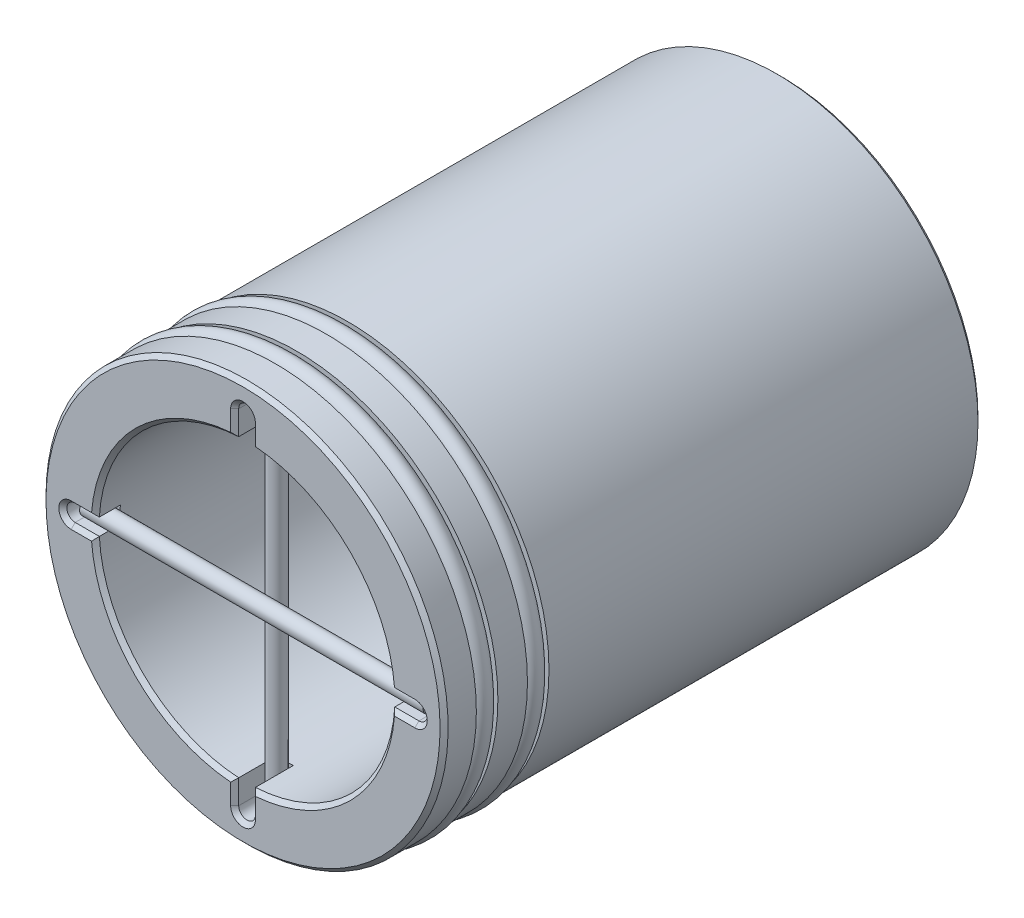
ISO-10303-21;
HEADER;
FILE_DESCRIPTION(('STEP AP214'),'2;1');
FILE_NAME('part.step','',(''),(''),'','','');
FILE_SCHEMA(('AUTOMOTIVE_DESIGN { 1 0 10303 214 1 1 1 1 }'));
ENDSEC;
DATA;
#1=APPLICATION_CONTEXT('core data for automotive mechanical design processes');
#2=APPLICATION_PROTOCOL_DEFINITION('international standard','automotive_design',2000,#1);
#3=PRODUCT_CONTEXT('',#1,'mechanical');
#4=PRODUCT('Part','Part','',(#3));
#5=PRODUCT_RELATED_PRODUCT_CATEGORY('part','',(#4));
#6=PRODUCT_DEFINITION_FORMATION('','',#4);
#7=PRODUCT_DEFINITION_CONTEXT('part definition',#1,'design');
#8=PRODUCT_DEFINITION('design','',#6,#7);
#9=PRODUCT_DEFINITION_SHAPE('','',#8);
#10=(LENGTH_UNIT() NAMED_UNIT(*) SI_UNIT(.MILLI.,.METRE.));
#11=(NAMED_UNIT(*) PLANE_ANGLE_UNIT() SI_UNIT($,.RADIAN.));
#12=(NAMED_UNIT(*) SI_UNIT($,.STERADIAN.) SOLID_ANGLE_UNIT());
#13=UNCERTAINTY_MEASURE_WITH_UNIT(LENGTH_MEASURE(1.E-05),#10,'distance_accuracy_value','');
#14=(GEOMETRIC_REPRESENTATION_CONTEXT(3) GLOBAL_UNCERTAINTY_ASSIGNED_CONTEXT((#13)) GLOBAL_UNIT_ASSIGNED_CONTEXT((#10,
#11,#12)) REPRESENTATION_CONTEXT('',''));
#15=CARTESIAN_POINT('',(0.,0.,0.));
#16=DIRECTION('',(0.,0.,1.));
#17=DIRECTION('',(1.,0.,0.));
#18=AXIS2_PLACEMENT_3D('',#15,#16,#17);
#19=CARTESIAN_POINT('',(16.2179,0.,49.2252));
#20=DIRECTION('',(1.,0.,0.));
#21=DIRECTION('',(0.,0.,-1.));
#22=AXIS2_PLACEMENT_3D('',#19,#20,#21);
#23=PLANE('',#22);
#24=CARTESIAN_POINT('',(16.2179,0.,49.2252));
#25=DIRECTION('',(-1.,0.,0.));
#26=DIRECTION('',(0.,0.,1.));
#27=AXIS2_PLACEMENT_3D('',#24,#25,#26);
#28=CIRCLE('',#27,0.787399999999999);
#29=CARTESIAN_POINT('',(16.2179,0.,50.0126));
#30=VERTEX_POINT('',#29);
#31=EDGE_CURVE('P0_E18',#30,#30,#28,.T.);
#32=ORIENTED_EDGE('',*,*,#31,.F.);
#33=EDGE_LOOP('',(#32));
#34=FACE_BOUND('',#33,.T.);
#35=ADVANCED_FACE('P0_F15',(#34),#23,.T.);
#36=CARTESIAN_POINT('',(-16.2179,0.,49.2252));
#37=DIRECTION('',(1.,0.,0.));
#38=DIRECTION('',(0.,0.,-1.));
#39=AXIS2_PLACEMENT_3D('',#36,#37,#38);
#40=PLANE('',#39);
#41=CARTESIAN_POINT('',(-16.2179,0.,49.2252));
#42=DIRECTION('',(-1.,0.,0.));
#43=DIRECTION('',(0.,0.,1.));
#44=AXIS2_PLACEMENT_3D('',#41,#42,#43);
#45=CIRCLE('',#44,0.787399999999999);
#46=CARTESIAN_POINT('',(-16.2179,0.,50.0126));
#47=VERTEX_POINT('',#46);
#48=EDGE_CURVE('P0_E10',#47,#47,#45,.F.);
#49=ORIENTED_EDGE('',*,*,#48,.F.);
#50=EDGE_LOOP('',(#49));
#51=FACE_BOUND('',#50,.T.);
#52=ADVANCED_FACE('P0_F30',(#51),#40,.F.);
#53=CARTESIAN_POINT('',(16.2179,0.,49.2252));
#54=DIRECTION('',(-1.,0.,0.));
#55=DIRECTION('',(0.,0.,1.));
#56=AXIS2_PLACEMENT_3D('',#53,#54,#55);
#57=CYLINDRICAL_SURFACE('',#56,0.787399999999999);
#58=ORIENTED_EDGE('',*,*,#48,.T.);
#59=EDGE_LOOP('',(#58));
#60=FACE_BOUND('',#59,.T.);
#61=ORIENTED_EDGE('',*,*,#31,.T.);
#62=EDGE_LOOP('',(#61));
#63=FACE_BOUND('',#62,.T.);
#64=ADVANCED_FACE('P0_F27',(#60,#63),#57,.T.);
#65=CLOSED_SHELL('',(#35,#52,#64));
#66=MANIFOLD_SOLID_BREP('P0_B1',#65);
#67=CARTESIAN_POINT('',(0.,0.,41.91));
#68=DIRECTION('',(0.,0.,-1.));
#69=DIRECTION('',(-1.,0.,0.));
#70=AXIS2_PLACEMENT_3D('',#67,#68,#69);
#71=TOROIDAL_SURFACE('',#70,18.3134,0.914399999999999);
#72=ADVANCED_FACE('P1_F14',(),#71,.T.);
#73=CLOSED_SHELL('',(#72));
#74=MANIFOLD_SOLID_BREP('P1_B1',#73);
#75=CARTESIAN_POINT('',(0.,0.,46.736));
#76=DIRECTION('',(0.,0.,-1.));
#77=DIRECTION('',(-1.,0.,0.));
#78=AXIS2_PLACEMENT_3D('',#75,#76,#77);
#79=TOROIDAL_SURFACE('',#78,18.3134,0.914399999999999);
#80=ADVANCED_FACE('P2_F13',(),#79,.T.);
#81=CLOSED_SHELL('',(#80));
#82=MANIFOLD_SOLID_BREP('P2_B1',#81);
#83=CARTESIAN_POINT('',(0.,0.,50.8));
#84=DIRECTION('',(0.,0.,-1.));
#85=DIRECTION('',(-1.,0.,0.));
#86=AXIS2_PLACEMENT_3D('',#83,#84,#85);
#87=CYLINDRICAL_SURFACE('',#86,18.9865);
#88=CARTESIAN_POINT('',(0.,0.,47.752));
#89=DIRECTION('',(0.,0.,-1.));
#90=DIRECTION('',(-1.,0.,0.));
#91=AXIS2_PLACEMENT_3D('',#88,#89,#90);
#92=CIRCLE('',#91,18.9865);
#93=CARTESIAN_POINT('',(-18.9865,0.,47.752));
#94=VERTEX_POINT('',#93);
#95=EDGE_CURVE('P3_E20',#94,#94,#92,.F.);
#96=ORIENTED_EDGE('',*,*,#95,.T.);
#97=EDGE_LOOP('',(#96));
#98=FACE_BOUND('',#97,.T.);
#99=CARTESIAN_POINT('',(0.,0.,50.419));
#100=DIRECTION('',(0.,0.,-1.));
#101=DIRECTION('',(-1.,0.,0.));
#102=AXIS2_PLACEMENT_3D('',#99,#100,#101);
#103=CIRCLE('',#102,18.9865);
#104=CARTESIAN_POINT('',(-18.9865,0.,50.419));
#105=VERTEX_POINT('',#104);
#106=EDGE_CURVE('P3_E208',#105,#105,#103,.F.);
#107=ORIENTED_EDGE('',*,*,#106,.F.);
#108=EDGE_LOOP('',(#107));
#109=FACE_BOUND('',#108,.T.);
#110=ADVANCED_FACE('P3_F17',(#98,#109),#87,.T.);
#111=CARTESIAN_POINT('',(0.,0.,50.419));
#112=DIRECTION('',(0.,0.,-1.));
#113=DIRECTION('',(0.,1.,0.));
#114=AXIS2_PLACEMENT_3D('',#111,#112,#113);
#115=CONICAL_SURFACE('',#114,18.9865,0.785398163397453);
#116=ORIENTED_EDGE('',*,*,#106,.T.);
#117=EDGE_LOOP('',(#116));
#118=FACE_BOUND('',#117,.T.);
#119=CARTESIAN_POINT('',(0.,0.,50.8));
#120=DIRECTION('',(0.,0.,-1.));
#121=DIRECTION('',(0.,1.,0.));
#122=AXIS2_PLACEMENT_3D('',#119,#120,#121);
#123=CIRCLE('',#122,18.6055);
#124=CARTESIAN_POINT('',(0.,18.6055,50.8));
#125=VERTEX_POINT('',#124);
#126=EDGE_CURVE('P3_E283',#125,#125,#123,.F.);
#127=ORIENTED_EDGE('',*,*,#126,.F.);
#128=EDGE_LOOP('',(#127));
#129=FACE_BOUND('',#128,.T.);
#130=ADVANCED_FACE('P3_F402',(#118,#129),#115,.T.);
#131=CARTESIAN_POINT('',(0.,-16.2306,50.8));
#132=DIRECTION('',(0.,0.,1.));
#133=DIRECTION('',(1.,0.,0.));
#134=AXIS2_PLACEMENT_3D('',#131,#132,#133);
#135=CONICAL_SURFACE('',#134,1.16840000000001,0.785398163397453);
#136=DIRECTION('',(0.707106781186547,0.,-0.707106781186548));
#137=VECTOR('',#136,1.);
#138=CARTESIAN_POINT('',(-0.787399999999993,-16.2306,50.419));
#139=LINE('',#138,#137);
#140=CARTESIAN_POINT('',(-1.1684,-16.2306,50.8));
#141=VERTEX_POINT('',#140);
#142=CARTESIAN_POINT('',(-0.787399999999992,-16.2306,50.419));
#143=VERTEX_POINT('',#142);
#144=EDGE_CURVE('P3_E361',#141,#143,#139,.T.);
#145=ORIENTED_EDGE('',*,*,#144,.F.);
#146=CARTESIAN_POINT('',(0.,-16.2306,50.8));
#147=DIRECTION('',(0.,0.,1.));
#148=DIRECTION('',(1.,0.,0.));
#149=AXIS2_PLACEMENT_3D('',#146,#147,#148);
#150=CIRCLE('',#149,1.16840000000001);
#151=CARTESIAN_POINT('',(1.1684,-16.2306,50.8));
#152=VERTEX_POINT('',#151);
#153=EDGE_CURVE('P3_E501',#152,#141,#150,.F.);
#154=ORIENTED_EDGE('',*,*,#153,.F.);
#155=DIRECTION('',(0.707106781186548,0.,0.707106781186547));
#156=VECTOR('',#155,1.);
#157=CARTESIAN_POINT('',(0.787399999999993,-16.2306,50.419));
#158=LINE('',#157,#156);
#159=CARTESIAN_POINT('',(0.787399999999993,-16.2306,50.419));
#160=VERTEX_POINT('',#159);
#161=EDGE_CURVE('P3_E367',#160,#152,#158,.T.);
#162=ORIENTED_EDGE('',*,*,#161,.F.);
#163=CARTESIAN_POINT('',(0.,-16.2306,50.419));
#164=DIRECTION('',(0.,0.,1.));
#165=DIRECTION('',(1.,0.,0.));
#166=AXIS2_PLACEMENT_3D('',#163,#164,#165);
#167=CIRCLE('',#166,0.787399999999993);
#168=EDGE_CURVE('P3_E362',#160,#143,#167,.F.);
#169=ORIENTED_EDGE('',*,*,#168,.T.);
#170=EDGE_LOOP('',(#145,#154,#162,#169));
#171=FACE_BOUND('',#170,.T.);
#172=ADVANCED_FACE('P3_F399',(#171),#135,.F.);
#173=CARTESIAN_POINT('',(-16.2306,0.,50.8));
#174=DIRECTION('',(0.,0.,1.));
#175=DIRECTION('',(0.,-1.,0.));
#176=AXIS2_PLACEMENT_3D('',#173,#174,#175);
#177=CONICAL_SURFACE('',#176,1.1684,0.785398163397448);
#178=DIRECTION('',(0.,-0.707106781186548,-0.707106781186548));
#179=VECTOR('',#178,1.);
#180=CARTESIAN_POINT('',(-16.2306,0.787399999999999,50.419));
#181=LINE('',#180,#179);
#182=CARTESIAN_POINT('',(-16.2306,1.16839999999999,50.8));
#183=VERTEX_POINT('',#182);
#184=CARTESIAN_POINT('',(-16.2306,0.787399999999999,50.419));
#185=VERTEX_POINT('',#184);
#186=EDGE_CURVE('P3_E299',#183,#185,#181,.T.);
#187=ORIENTED_EDGE('',*,*,#186,.F.);
#188=CARTESIAN_POINT('',(-16.2306,0.,50.8));
#189=DIRECTION('',(0.,0.,1.));
#190=DIRECTION('',(0.,-1.,0.));
#191=AXIS2_PLACEMENT_3D('',#188,#189,#190);
#192=CIRCLE('',#191,1.16839999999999);
#193=CARTESIAN_POINT('',(-16.2306,-1.16839999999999,50.8));
#194=VERTEX_POINT('',#193);
#195=EDGE_CURVE('P3_E494',#194,#183,#192,.F.);
#196=ORIENTED_EDGE('',*,*,#195,.F.);
#197=DIRECTION('',(0.,-0.707106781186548,0.707106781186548));
#198=VECTOR('',#197,1.);
#199=CARTESIAN_POINT('',(-16.2306,-0.787399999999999,50.419));
#200=LINE('',#199,#198);
#201=CARTESIAN_POINT('',(-16.2306,-0.787399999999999,50.419));
#202=VERTEX_POINT('',#201);
#203=EDGE_CURVE('P3_E585',#202,#194,#200,.T.);
#204=ORIENTED_EDGE('',*,*,#203,.F.);
#205=CARTESIAN_POINT('',(-16.2306,0.,50.419));
#206=DIRECTION('',(0.,0.,1.));
#207=DIRECTION('',(1.,0.,0.));
#208=AXIS2_PLACEMENT_3D('',#205,#206,#207);
#209=CIRCLE('',#208,0.787399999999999);
#210=EDGE_CURVE('P3_E560',#202,#185,#209,.F.);
#211=ORIENTED_EDGE('',*,*,#210,.T.);
#212=EDGE_LOOP('',(#187,#196,#204,#211));
#213=FACE_BOUND('',#212,.T.);
#214=ADVANCED_FACE('P3_F395',(#213),#177,.F.);
#215=CARTESIAN_POINT('',(0.,16.2306,50.8));
#216=DIRECTION('',(0.,0.,1.));
#217=DIRECTION('',(1.,0.,0.));
#218=AXIS2_PLACEMENT_3D('',#215,#216,#217);
#219=CONICAL_SURFACE('',#218,1.16840000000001,0.785398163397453);
#220=DIRECTION('',(0.707106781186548,0.,-0.707106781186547));
#221=VECTOR('',#220,1.);
#222=CARTESIAN_POINT('',(-0.787399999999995,16.2306,50.419));
#223=LINE('',#222,#221);
#224=CARTESIAN_POINT('',(-0.787399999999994,16.2306,50.419));
#225=VERTEX_POINT('',#224);
#226=CARTESIAN_POINT('',(-1.1684,16.2306,50.8));
#227=VERTEX_POINT('',#226);
#228=EDGE_CURVE('P3_E291',#225,#227,#223,.F.);
#229=ORIENTED_EDGE('',*,*,#228,.F.);
#230=CARTESIAN_POINT('',(0.,16.2306,50.419));
#231=DIRECTION('',(0.,0.,1.));
#232=DIRECTION('',(1.,0.,0.));
#233=AXIS2_PLACEMENT_3D('',#230,#231,#232);
#234=CIRCLE('',#233,0.787399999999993);
#235=CARTESIAN_POINT('',(0.787399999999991,16.2306,50.419));
#236=VERTEX_POINT('',#235);
#237=EDGE_CURVE('P3_E288',#225,#236,#234,.F.);
#238=ORIENTED_EDGE('',*,*,#237,.T.);
#239=DIRECTION('',(0.707106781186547,0.,0.707106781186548));
#240=VECTOR('',#239,1.);
#241=CARTESIAN_POINT('',(0.787399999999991,16.2306,50.419));
#242=LINE('',#241,#240);
#243=CARTESIAN_POINT('',(1.1684,16.2306,50.8));
#244=VERTEX_POINT('',#243);
#245=EDGE_CURVE('P3_E284',#244,#236,#242,.F.);
#246=ORIENTED_EDGE('',*,*,#245,.F.);
#247=CARTESIAN_POINT('',(0.,16.2306,50.8));
#248=DIRECTION('',(0.,0.,1.));
#249=DIRECTION('',(1.,0.,0.));
#250=AXIS2_PLACEMENT_3D('',#247,#248,#249);
#251=CIRCLE('',#250,1.16840000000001);
#252=EDGE_CURVE('P3_E487',#227,#244,#251,.F.);
#253=ORIENTED_EDGE('',*,*,#252,.F.);
#254=EDGE_LOOP('',(#229,#238,#246,#253));
#255=FACE_BOUND('',#254,.T.);
#256=ADVANCED_FACE('P3_F391',(#255),#219,.F.);
#257=CARTESIAN_POINT('',(16.2306,0.,50.8));
#258=DIRECTION('',(0.,0.,1.));
#259=DIRECTION('',(1.,0.,0.));
#260=AXIS2_PLACEMENT_3D('',#257,#258,#259);
#261=CONICAL_SURFACE('',#260,1.16840000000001,0.785398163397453);
#262=DIRECTION('',(0.,-0.707106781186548,0.707106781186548));
#263=VECTOR('',#262,1.);
#264=CARTESIAN_POINT('',(16.2306,-0.787399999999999,50.419));
#265=LINE('',#264,#263);
#266=CARTESIAN_POINT('',(16.2306,-1.1684,50.8));
#267=VERTEX_POINT('',#266);
#268=CARTESIAN_POINT('',(16.2306,-0.787399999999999,50.419));
#269=VERTEX_POINT('',#268);
#270=EDGE_CURVE('P3_E192',#267,#269,#265,.F.);
#271=ORIENTED_EDGE('',*,*,#270,.F.);
#272=CARTESIAN_POINT('',(16.2306,0.,50.8));
#273=DIRECTION('',(0.,0.,1.));
#274=DIRECTION('',(1.,0.,0.));
#275=AXIS2_PLACEMENT_3D('',#272,#273,#274);
#276=CIRCLE('',#275,1.16840000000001);
#277=CARTESIAN_POINT('',(16.2306,1.1684,50.8));
#278=VERTEX_POINT('',#277);
#279=EDGE_CURVE('P3_E483',#278,#267,#276,.F.);
#280=ORIENTED_EDGE('',*,*,#279,.F.);
#281=DIRECTION('',(0.,-0.707106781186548,-0.707106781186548));
#282=VECTOR('',#281,1.);
#283=CARTESIAN_POINT('',(16.2306,25.4,75.0316));
#284=LINE('',#283,#282);
#285=CARTESIAN_POINT('',(16.2306,0.787399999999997,50.419));
#286=VERTEX_POINT('',#285);
#287=EDGE_CURVE('P3_E205',#286,#278,#284,.F.);
#288=ORIENTED_EDGE('',*,*,#287,.F.);
#289=CARTESIAN_POINT('',(16.2306,0.,50.419));
#290=DIRECTION('',(0.,0.,1.));
#291=DIRECTION('',(1.,0.,0.));
#292=AXIS2_PLACEMENT_3D('',#289,#290,#291);
#293=CIRCLE('',#292,0.787399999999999);
#294=EDGE_CURVE('P3_E195',#286,#269,#293,.F.);
#295=ORIENTED_EDGE('',*,*,#294,.T.);
#296=EDGE_LOOP('',(#271,#280,#288,#295));
#297=FACE_BOUND('',#296,.T.);
#298=ADVANCED_FACE('P3_F387',(#297),#261,.F.);
#299=CARTESIAN_POINT('',(0.,0.,47.752));
#300=DIRECTION('',(0.,0.,1.));
#301=DIRECTION('',(1.,0.,0.));
#302=AXIS2_PLACEMENT_3D('',#299,#300,#301);
#303=PLANE('',#302);
#304=CARTESIAN_POINT('',(0.,0.,47.752));
#305=DIRECTION('',(0.,0.,1.));
#306=DIRECTION('',(1.,0.,0.));
#307=AXIS2_PLACEMENT_3D('',#304,#305,#306);
#308=CIRCLE('',#307,17.399);
#309=CARTESIAN_POINT('',(17.399,0.,47.752));
#310=VERTEX_POINT('',#309);
#311=EDGE_CURVE('P3_E171',#310,#310,#308,.F.);
#312=ORIENTED_EDGE('',*,*,#311,.F.);
#313=EDGE_LOOP('',(#312));
#314=FACE_BOUND('',#313,.T.);
#315=ORIENTED_EDGE('',*,*,#95,.F.);
#316=EDGE_LOOP('',(#315));
#317=FACE_BOUND('',#316,.T.);
#318=ADVANCED_FACE('P3_F381',(#314,#317),#303,.F.);
#319=CARTESIAN_POINT('',(-16.2306,-0.787399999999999,50.419));
#320=DIRECTION('',(0.,0.707106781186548,0.707106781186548));
#321=DIRECTION('',(0.,-0.707106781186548,0.707106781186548));
#322=AXIS2_PLACEMENT_3D('',#319,#320,#321);
#323=PLANE('',#322);
#324=DIRECTION('',(1.,0.,0.));
#325=VECTOR('',#324,1.);
#326=CARTESIAN_POINT('',(-16.2306,-0.787399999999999,50.419));
#327=LINE('',#326,#325);
#328=CARTESIAN_POINT('',(13.9477919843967,-0.787399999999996,50.419));
#329=VERTEX_POINT('',#328);
#330=EDGE_CURVE('P3_E187',#269,#329,#327,.F.);
#331=ORIENTED_EDGE('',*,*,#330,.T.);
#332=CARTESIAN_POINT('',(13.9477919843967,-0.787400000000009,50.419));
#333=CARTESIAN_POINT('',(14.0075725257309,-0.850657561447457,50.4822575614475));
#334=CARTESIAN_POINT('',(14.0670932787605,-0.914036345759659,50.5456363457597));
#335=CARTESIAN_POINT('',(14.1856151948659,-1.04103634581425,50.6726363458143));
#336=CARTESIAN_POINT('',(14.2446163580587,-1.10465756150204,50.736257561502));
#337=CARTESIAN_POINT('',(14.3033577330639,-1.1684,50.8));
#338=B_SPLINE_CURVE_WITH_KNOTS('',3,(#332,#333,#334,#335,#336,#337),.UNSPECIFIED.,.F.,.F.,(4,2,
4),(0.,0.322781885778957,0.645563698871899),.UNSPECIFIED.);
#339=CARTESIAN_POINT('',(14.3033577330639,-1.1684,50.8));
#340=VERTEX_POINT('',#339);
#341=EDGE_CURVE('P3_E146',#329,#340,#338,.T.);
#342=ORIENTED_EDGE('',*,*,#341,.T.);
#343=DIRECTION('',(1.,0.,0.));
#344=VECTOR('',#343,1.);
#345=CARTESIAN_POINT('',(0.,-1.1684,50.8));
#346=LINE('',#345,#344);
#347=EDGE_CURVE('P3_E480',#267,#340,#346,.F.);
#348=ORIENTED_EDGE('',*,*,#347,.F.);
#349=ORIENTED_EDGE('',*,*,#270,.T.);
#350=EDGE_LOOP('',(#331,#342,#348,#349));
#351=FACE_BOUND('',#350,.T.);
#352=ADVANCED_FACE('P3_F375',(#351),#323,.T.);
#353=CARTESIAN_POINT('',(0.787399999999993,-16.2306,50.419));
#354=DIRECTION('',(-0.707106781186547,0.,0.707106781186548));
#355=DIRECTION('',(0.707106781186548,0.,0.707106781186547));
#356=AXIS2_PLACEMENT_3D('',#353,#354,#355);
#357=PLANE('',#356);
#358=DIRECTION('',(0.,1.,0.));
#359=VECTOR('',#358,1.);
#360=CARTESIAN_POINT('',(1.1684,0.,50.8));
#361=LINE('',#360,#359);
#362=CARTESIAN_POINT('',(1.1684,-14.3033577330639,50.8));
#363=VERTEX_POINT('',#362);
#364=EDGE_CURVE('P3_E502',#363,#152,#361,.F.);
#365=ORIENTED_EDGE('',*,*,#364,.F.);
#366=CARTESIAN_POINT('',(1.1684,-14.3033577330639,50.8));
#367=CARTESIAN_POINT('',(1.10465756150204,-14.2446163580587,50.736257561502));
#368=CARTESIAN_POINT('',(1.04103634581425,-14.1856151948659,50.6726363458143));
#369=CARTESIAN_POINT('',(0.914036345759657,-14.0670932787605,50.5456363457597));
#370=CARTESIAN_POINT('',(0.850657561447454,-14.0075725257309,50.4822575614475));
#371=CARTESIAN_POINT('',(0.787400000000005,-13.9477919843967,50.419));
#372=B_SPLINE_CURVE_WITH_KNOTS('',3,(#366,#367,#368,#369,#370,#371),.UNSPECIFIED.,.F.,.F.,(4,2,
4),(0.,0.322781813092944,0.645563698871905),.UNSPECIFIED.);
#373=CARTESIAN_POINT('',(0.787399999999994,-13.9477919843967,50.419));
#374=VERTEX_POINT('',#373);
#375=EDGE_CURVE('P3_E629',#363,#374,#372,.T.);
#376=ORIENTED_EDGE('',*,*,#375,.T.);
#377=DIRECTION('',(0.,1.,0.));
#378=VECTOR('',#377,1.);
#379=CARTESIAN_POINT('',(0.787399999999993,-16.2306,50.419));
#380=LINE('',#379,#378);
#381=EDGE_CURVE('P3_E616',#374,#160,#380,.F.);
#382=ORIENTED_EDGE('',*,*,#381,.T.);
#383=ORIENTED_EDGE('',*,*,#161,.T.);
#384=EDGE_LOOP('',(#365,#376,#382,#383));
#385=FACE_BOUND('',#384,.T.);
#386=ADVANCED_FACE('P3_F380',(#385),#357,.T.);
#387=CARTESIAN_POINT('',(0.,-16.2306,46.8376));
#388=DIRECTION('',(0.,0.,1.));
#389=DIRECTION('',(1.,0.,0.));
#390=AXIS2_PLACEMENT_3D('',#387,#388,#389);
#391=PLANE('',#390);
#392=CARTESIAN_POINT('',(0.,0.,46.8376));
#393=DIRECTION('',(0.,0.,-1.));
#394=DIRECTION('',(-1.,0.,0.));
#395=AXIS2_PLACEMENT_3D('',#392,#393,#394);
#396=CIRCLE('',#395,13.97);
#397=CARTESIAN_POINT('',(0.787399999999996,-13.9477919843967,46.8376));
#398=VERTEX_POINT('',#397);
#399=CARTESIAN_POINT('',(-0.787399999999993,-13.9477919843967,46.8376));
#400=VERTEX_POINT('',#399);
#401=EDGE_CURVE('P3_E366',#398,#400,#396,.T.);
#402=ORIENTED_EDGE('',*,*,#401,.T.);
#403=DIRECTION('',(0.,-1.,0.));
#404=VECTOR('',#403,1.);
#405=CARTESIAN_POINT('',(-0.787399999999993,-16.2306,46.8376));
#406=LINE('',#405,#404);
#407=CARTESIAN_POINT('',(-0.787399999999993,-16.2306,46.8376));
#408=VERTEX_POINT('',#407);
#409=EDGE_CURVE('P3_E609',#400,#408,#406,.T.);
#410=ORIENTED_EDGE('',*,*,#409,.T.);
#411=CARTESIAN_POINT('',(0.,-16.2306,46.8376));
#412=DIRECTION('',(0.,0.,1.));
#413=DIRECTION('',(1.,0.,0.));
#414=AXIS2_PLACEMENT_3D('',#411,#412,#413);
#415=CIRCLE('',#414,0.787399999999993);
#416=CARTESIAN_POINT('',(0.787399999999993,-16.2306,46.8376));
#417=VERTEX_POINT('',#416);
#418=EDGE_CURVE('P3_E364',#408,#417,#415,.T.);
#419=ORIENTED_EDGE('',*,*,#418,.T.);
#420=DIRECTION('',(0.,1.,0.));
#421=VECTOR('',#420,1.);
#422=CARTESIAN_POINT('',(0.787399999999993,-16.2306,46.8376));
#423=LINE('',#422,#421);
#424=EDGE_CURVE('P3_E185',#417,#398,#423,.T.);
#425=ORIENTED_EDGE('',*,*,#424,.T.);
#426=EDGE_LOOP('',(#402,#410,#419,#425));
#427=FACE_BOUND('',#426,.T.);
#428=ADVANCED_FACE('P3_F744',(#427),#391,.T.);
#429=CARTESIAN_POINT('',(0.,-16.2306,46.8376));
#430=DIRECTION('',(0.,0.,1.));
#431=DIRECTION('',(1.,0.,0.));
#432=AXIS2_PLACEMENT_3D('',#429,#430,#431);
#433=CYLINDRICAL_SURFACE('',#432,0.787399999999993);
#434=DIRECTION('',(0.,0.,1.));
#435=VECTOR('',#434,1.);
#436=CARTESIAN_POINT('',(0.787399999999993,-16.2306,46.8376));
#437=LINE('',#436,#435);
#438=EDGE_CURVE('P3_E627',#160,#417,#437,.F.);
#439=ORIENTED_EDGE('',*,*,#438,.T.);
#440=ORIENTED_EDGE('',*,*,#418,.F.);
#441=DIRECTION('',(0.,0.,1.));
#442=VECTOR('',#441,1.);
#443=CARTESIAN_POINT('',(-0.787399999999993,-16.2306,46.8376));
#444=LINE('',#443,#442);
#445=EDGE_CURVE('P3_E600',#408,#143,#444,.T.);
#446=ORIENTED_EDGE('',*,*,#445,.T.);
#447=ORIENTED_EDGE('',*,*,#168,.F.);
#448=EDGE_LOOP('',(#439,#440,#446,#447));
#449=FACE_BOUND('',#448,.T.);
#450=ADVANCED_FACE('P3_F746',(#449),#433,.F.);
#451=CARTESIAN_POINT('',(-0.787399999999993,-16.2306,50.419));
#452=DIRECTION('',(0.707106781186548,0.,0.707106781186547));
#453=DIRECTION('',(0.707106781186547,0.,-0.707106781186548));
#454=AXIS2_PLACEMENT_3D('',#451,#452,#453);
#455=PLANE('',#454);
#456=DIRECTION('',(0.,1.,0.));
#457=VECTOR('',#456,1.);
#458=CARTESIAN_POINT('',(-1.1684,0.,50.8));
#459=LINE('',#458,#457);
#460=CARTESIAN_POINT('',(-1.1684,-14.303357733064,50.8));
#461=VERTEX_POINT('',#460);
#462=EDGE_CURVE('P3_E498',#141,#461,#459,.T.);
#463=ORIENTED_EDGE('',*,*,#462,.F.);
#464=ORIENTED_EDGE('',*,*,#144,.T.);
#465=DIRECTION('',(0.,-1.,0.));
#466=VECTOR('',#465,1.);
#467=CARTESIAN_POINT('',(-0.787399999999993,-16.2306,50.419));
#468=LINE('',#467,#466);
#469=CARTESIAN_POINT('',(-0.787399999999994,-13.9477919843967,50.419));
#470=VERTEX_POINT('',#469);
#471=EDGE_CURVE('P3_E597',#143,#470,#468,.F.);
#472=ORIENTED_EDGE('',*,*,#471,.T.);
#473=CARTESIAN_POINT('',(-0.787399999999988,-13.9477919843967,50.419));
#474=CARTESIAN_POINT('',(-0.850657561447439,-14.0075725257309,50.4822575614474));
#475=CARTESIAN_POINT('',(-0.914036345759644,-14.0670932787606,50.5456363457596));
#476=CARTESIAN_POINT('',(-1.04103634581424,-14.185615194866,50.6726363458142));
#477=CARTESIAN_POINT('',(-1.10465756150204,-14.2446163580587,50.736257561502));
#478=CARTESIAN_POINT('',(-1.1684,-14.303357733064,50.8));
#479=B_SPLINE_CURVE_WITH_KNOTS('',3,(#473,#474,#475,#476,#477,#478),.UNSPECIFIED.,.F.,.F.,(4,2,
4),(0.,0.322781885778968,0.645563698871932),.UNSPECIFIED.);
#480=EDGE_CURVE('P3_E356',#470,#461,#479,.T.);
#481=ORIENTED_EDGE('',*,*,#480,.T.);
#482=EDGE_LOOP('',(#463,#464,#472,#481));
#483=FACE_BOUND('',#482,.T.);
#484=ADVANCED_FACE('P3_F326',(#483),#455,.T.);
#485=CARTESIAN_POINT('',(-16.2306,-0.787399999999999,50.419));
#486=DIRECTION('',(0.,0.707106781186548,0.707106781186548));
#487=DIRECTION('',(0.,-0.707106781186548,0.707106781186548));
#488=AXIS2_PLACEMENT_3D('',#485,#486,#487);
#489=PLANE('',#488);
#490=DIRECTION('',(1.,0.,0.));
#491=VECTOR('',#490,1.);
#492=CARTESIAN_POINT('',(0.,-1.1684,50.8));
#493=LINE('',#492,#491);
#494=CARTESIAN_POINT('',(-14.303357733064,-1.1684,50.8));
#495=VERTEX_POINT('',#494);
#496=EDGE_CURVE('P3_E495',#495,#194,#493,.F.);
#497=ORIENTED_EDGE('',*,*,#496,.F.);
#498=CARTESIAN_POINT('',(-14.3033577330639,-1.1684,50.8));
#499=CARTESIAN_POINT('',(-14.2446163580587,-1.10465756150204,50.736257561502));
#500=CARTESIAN_POINT('',(-14.185615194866,-1.04103634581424,50.6726363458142));
#501=CARTESIAN_POINT('',(-14.0670932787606,-0.914036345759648,50.5456363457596));
#502=CARTESIAN_POINT('',(-14.0075725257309,-0.850657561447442,50.4822575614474));
#503=CARTESIAN_POINT('',(-13.9477919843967,-0.78739999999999,50.419));
#504=B_SPLINE_CURVE_WITH_KNOTS('',3,(#498,#499,#500,#501,#502,#503),.UNSPECIFIED.,.F.,.F.,(4,2,
4),(0.,0.322781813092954,0.645563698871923),.UNSPECIFIED.);
#505=CARTESIAN_POINT('',(-13.9477919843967,-0.787399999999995,50.419));
#506=VERTEX_POINT('',#505);
#507=EDGE_CURVE('P3_E331',#495,#506,#504,.T.);
#508=ORIENTED_EDGE('',*,*,#507,.T.);
#509=DIRECTION('',(1.,0.,0.));
#510=VECTOR('',#509,1.);
#511=CARTESIAN_POINT('',(-16.2306,-0.787399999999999,50.419));
#512=LINE('',#511,#510);
#513=EDGE_CURVE('P3_E573',#506,#202,#512,.F.);
#514=ORIENTED_EDGE('',*,*,#513,.T.);
#515=ORIENTED_EDGE('',*,*,#203,.T.);
#516=EDGE_LOOP('',(#497,#508,#514,#515));
#517=FACE_BOUND('',#516,.T.);
#518=ADVANCED_FACE('P3_F321',(#517),#489,.T.);
#519=CARTESIAN_POINT('',(-16.2306,0.,48.4378));
#520=DIRECTION('',(0.,0.,1.));
#521=DIRECTION('',(1.,0.,0.));
#522=AXIS2_PLACEMENT_3D('',#519,#520,#521);
#523=PLANE('',#522);
#524=CARTESIAN_POINT('',(0.,0.,48.4378));
#525=DIRECTION('',(0.,0.,-1.));
#526=DIRECTION('',(-1.,0.,0.));
#527=AXIS2_PLACEMENT_3D('',#524,#525,#526);
#528=CIRCLE('',#527,13.97);
#529=CARTESIAN_POINT('',(-13.9477919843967,-0.7874,48.4378));
#530=VERTEX_POINT('',#529);
#531=CARTESIAN_POINT('',(-13.9477919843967,0.787399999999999,48.4378));
#532=VERTEX_POINT('',#531);
#533=EDGE_CURVE('P3_E363',#530,#532,#528,.T.);
#534=ORIENTED_EDGE('',*,*,#533,.T.);
#535=DIRECTION('',(1.,0.,0.));
#536=VECTOR('',#535,1.);
#537=CARTESIAN_POINT('',(-16.2306,0.787399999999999,48.4378));
#538=LINE('',#537,#536);
#539=CARTESIAN_POINT('',(-16.2306,0.787399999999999,48.4378));
#540=VERTEX_POINT('',#539);
#541=EDGE_CURVE('P3_E565',#532,#540,#538,.F.);
#542=ORIENTED_EDGE('',*,*,#541,.T.);
#543=CARTESIAN_POINT('',(-16.2306,0.,48.4378));
#544=DIRECTION('',(0.,0.,1.));
#545=DIRECTION('',(1.,0.,0.));
#546=AXIS2_PLACEMENT_3D('',#543,#544,#545);
#547=CIRCLE('',#546,0.787399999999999);
#548=CARTESIAN_POINT('',(-16.2306,-0.787399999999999,48.4378));
#549=VERTEX_POINT('',#548);
#550=EDGE_CURVE('P3_E300',#540,#549,#547,.T.);
#551=ORIENTED_EDGE('',*,*,#550,.T.);
#552=DIRECTION('',(1.,0.,0.));
#553=VECTOR('',#552,1.);
#554=CARTESIAN_POINT('',(-16.2306,-0.787399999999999,48.4378));
#555=LINE('',#554,#553);
#556=EDGE_CURVE('P3_E580',#549,#530,#555,.T.);
#557=ORIENTED_EDGE('',*,*,#556,.T.);
#558=EDGE_LOOP('',(#534,#542,#551,#557));
#559=FACE_BOUND('',#558,.T.);
#560=ADVANCED_FACE('P3_F317',(#559),#523,.T.);
#561=CARTESIAN_POINT('',(-16.2306,0.,48.4378));
#562=DIRECTION('',(0.,0.,1.));
#563=DIRECTION('',(1.,0.,0.));
#564=AXIS2_PLACEMENT_3D('',#561,#562,#563);
#565=CYLINDRICAL_SURFACE('',#564,0.787399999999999);
#566=DIRECTION('',(0.,0.,-1.));
#567=VECTOR('',#566,1.);
#568=CARTESIAN_POINT('',(-16.2306,-0.787399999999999,48.4378));
#569=LINE('',#568,#567);
#570=EDGE_CURVE('P3_E338',#202,#549,#569,.T.);
#571=ORIENTED_EDGE('',*,*,#570,.T.);
#572=ORIENTED_EDGE('',*,*,#550,.F.);
#573=DIRECTION('',(0.,0.,1.));
#574=VECTOR('',#573,1.);
#575=CARTESIAN_POINT('',(-16.2306,0.787399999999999,48.4378));
#576=LINE('',#575,#574);
#577=EDGE_CURVE('P3_E555',#540,#185,#576,.T.);
#578=ORIENTED_EDGE('',*,*,#577,.T.);
#579=ORIENTED_EDGE('',*,*,#210,.F.);
#580=EDGE_LOOP('',(#571,#572,#578,#579));
#581=FACE_BOUND('',#580,.T.);
#582=ADVANCED_FACE('P3_F312',(#581),#565,.F.);
#583=CARTESIAN_POINT('',(-16.2306,0.787399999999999,50.419));
#584=DIRECTION('',(0.,-0.707106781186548,0.707106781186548));
#585=DIRECTION('',(0.,-0.707106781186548,-0.707106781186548));
#586=AXIS2_PLACEMENT_3D('',#583,#584,#585);
#587=PLANE('',#586);
#588=DIRECTION('',(1.,0.,0.));
#589=VECTOR('',#588,1.);
#590=CARTESIAN_POINT('',(-16.2306,0.787399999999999,50.419));
#591=LINE('',#590,#589);
#592=CARTESIAN_POINT('',(-13.9477919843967,0.787400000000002,50.419));
#593=VERTEX_POINT('',#592);
#594=EDGE_CURVE('P3_E552',#185,#593,#591,.T.);
#595=ORIENTED_EDGE('',*,*,#594,.T.);
#596=CARTESIAN_POINT('',(-13.9477919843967,0.787400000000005,50.419));
#597=CARTESIAN_POINT('',(-14.0075725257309,0.850657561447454,50.4822575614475));
#598=CARTESIAN_POINT('',(-14.0670932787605,0.914036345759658,50.5456363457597));
#599=CARTESIAN_POINT('',(-14.185615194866,1.04103634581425,50.6726363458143));
#600=CARTESIAN_POINT('',(-14.2446163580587,1.10465756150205,50.736257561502));
#601=CARTESIAN_POINT('',(-14.3033577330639,1.1684,50.8));
#602=B_SPLINE_CURVE_WITH_KNOTS('',3,(#596,#597,#598,#599,#600,#601),.UNSPECIFIED.,.F.,.F.,(4,2,
4),(0.,0.322781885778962,0.64556369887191),.UNSPECIFIED.);
#603=CARTESIAN_POINT('',(-14.3033577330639,1.1684,50.8));
#604=VERTEX_POINT('',#603);
#605=EDGE_CURVE('P3_E292',#593,#604,#602,.T.);
#606=ORIENTED_EDGE('',*,*,#605,.T.);
#607=DIRECTION('',(1.,0.,0.));
#608=VECTOR('',#607,1.);
#609=CARTESIAN_POINT('',(0.,1.1684,50.8));
#610=LINE('',#609,#608);
#611=EDGE_CURVE('P3_E491',#183,#604,#610,.T.);
#612=ORIENTED_EDGE('',*,*,#611,.F.);
#613=ORIENTED_EDGE('',*,*,#186,.T.);
#614=EDGE_LOOP('',(#595,#606,#612,#613));
#615=FACE_BOUND('',#614,.T.);
#616=ADVANCED_FACE('P3_F306',(#615),#587,.T.);
#617=CARTESIAN_POINT('',(-0.787399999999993,-16.2306,50.419));
#618=DIRECTION('',(0.707106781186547,0.,0.707106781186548));
#619=DIRECTION('',(0.707106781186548,0.,-0.707106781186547));
#620=AXIS2_PLACEMENT_3D('',#617,#618,#619);
#621=PLANE('',#620);
#622=DIRECTION('',(0.,-1.,0.));
#623=VECTOR('',#622,1.);
#624=CARTESIAN_POINT('',(-0.787399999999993,-16.2306,50.419));
#625=LINE('',#624,#623);
#626=CARTESIAN_POINT('',(-0.787399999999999,13.9477919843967,50.419));
#627=VERTEX_POINT('',#626);
#628=EDGE_CURVE('P3_E527',#627,#225,#625,.F.);
#629=ORIENTED_EDGE('',*,*,#628,.T.);
#630=ORIENTED_EDGE('',*,*,#228,.T.);
#631=DIRECTION('',(0.,1.,0.));
#632=VECTOR('',#631,1.);
#633=CARTESIAN_POINT('',(-1.1684,0.,50.8));
#634=LINE('',#633,#632);
#635=CARTESIAN_POINT('',(-1.1684,14.3033577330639,50.8));
#636=VERTEX_POINT('',#635);
#637=EDGE_CURVE('P3_E488',#636,#227,#634,.T.);
#638=ORIENTED_EDGE('',*,*,#637,.F.);
#639=CARTESIAN_POINT('',(-1.1684,14.3033577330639,50.8));
#640=CARTESIAN_POINT('',(-1.10465756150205,14.2446163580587,50.736257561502));
#641=CARTESIAN_POINT('',(-1.04103634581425,14.185615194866,50.6726363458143));
#642=CARTESIAN_POINT('',(-0.914036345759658,14.0670932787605,50.5456363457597));
#643=CARTESIAN_POINT('',(-0.850657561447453,14.0075725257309,50.4822575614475));
#644=CARTESIAN_POINT('',(-0.787400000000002,13.9477919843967,50.419));
#645=B_SPLINE_CURVE_WITH_KNOTS('',3,(#639,#640,#641,#642,#643,#644),.UNSPECIFIED.,.F.,.F.,(4,2,
4),(0.,0.322781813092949,0.645563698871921),.UNSPECIFIED.);
#646=EDGE_CURVE('P3_E340',#636,#627,#645,.T.);
#647=ORIENTED_EDGE('',*,*,#646,.T.);
#648=EDGE_LOOP('',(#629,#630,#638,#647));
#649=FACE_BOUND('',#648,.T.);
#650=ADVANCED_FACE('P3_F311',(#649),#621,.T.);
#651=CARTESIAN_POINT('',(0.,-16.2306,46.8376));
#652=DIRECTION('',(0.,0.,1.));
#653=DIRECTION('',(1.,0.,0.));
#654=AXIS2_PLACEMENT_3D('',#651,#652,#653);
#655=PLANE('',#654);
#656=CARTESIAN_POINT('',(0.,0.,46.8376));
#657=DIRECTION('',(0.,0.,-1.));
#658=DIRECTION('',(-1.,0.,0.));
#659=AXIS2_PLACEMENT_3D('',#656,#657,#658);
#660=CIRCLE('',#659,13.97);
#661=CARTESIAN_POINT('',(-0.787399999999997,13.9477919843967,46.8376));
#662=VERTEX_POINT('',#661);
#663=CARTESIAN_POINT('',(0.787399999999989,13.9477919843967,46.8376));
#664=VERTEX_POINT('',#663);
#665=EDGE_CURVE('P3_E289',#662,#664,#660,.T.);
#666=ORIENTED_EDGE('',*,*,#665,.T.);
#667=DIRECTION('',(0.,1.,0.));
#668=VECTOR('',#667,1.);
#669=CARTESIAN_POINT('',(0.787399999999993,-16.2306,46.8376));
#670=LINE('',#669,#668);
#671=CARTESIAN_POINT('',(0.787399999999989,16.2306,46.8376));
#672=VERTEX_POINT('',#671);
#673=EDGE_CURVE('P3_E519',#664,#672,#670,.T.);
#674=ORIENTED_EDGE('',*,*,#673,.T.);
#675=CARTESIAN_POINT('',(0.,16.2306,46.8376));
#676=DIRECTION('',(0.,0.,1.));
#677=DIRECTION('',(1.,0.,0.));
#678=AXIS2_PLACEMENT_3D('',#675,#676,#677);
#679=CIRCLE('',#678,0.787399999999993);
#680=CARTESIAN_POINT('',(-0.787399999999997,16.2306,46.8376));
#681=VERTEX_POINT('',#680);
#682=EDGE_CURVE('P3_E286',#672,#681,#679,.T.);
#683=ORIENTED_EDGE('',*,*,#682,.T.);
#684=DIRECTION('',(0.,-1.,0.));
#685=VECTOR('',#684,1.);
#686=CARTESIAN_POINT('',(-0.787399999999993,-16.2306,46.8376));
#687=LINE('',#686,#685);
#688=EDGE_CURVE('P3_E534',#681,#662,#687,.T.);
#689=ORIENTED_EDGE('',*,*,#688,.T.);
#690=EDGE_LOOP('',(#666,#674,#683,#689));
#691=FACE_BOUND('',#690,.T.);
#692=ADVANCED_FACE('P3_F701',(#691),#655,.T.);
#693=CARTESIAN_POINT('',(0.,16.2306,46.8376));
#694=DIRECTION('',(0.,0.,1.));
#695=DIRECTION('',(1.,0.,0.));
#696=AXIS2_PLACEMENT_3D('',#693,#694,#695);
#697=CYLINDRICAL_SURFACE('',#696,0.787399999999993);
#698=DIRECTION('',(0.,0.,1.));
#699=VECTOR('',#698,1.);
#700=CARTESIAN_POINT('',(-0.787399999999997,16.2306,46.8376));
#701=LINE('',#700,#699);
#702=EDGE_CURVE('P3_E542',#225,#681,#701,.F.);
#703=ORIENTED_EDGE('',*,*,#702,.T.);
#704=ORIENTED_EDGE('',*,*,#682,.F.);
#705=DIRECTION('',(0.,0.,1.));
#706=VECTOR('',#705,1.);
#707=CARTESIAN_POINT('',(0.787399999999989,16.2306,46.8376));
#708=LINE('',#707,#706);
#709=EDGE_CURVE('P3_E510',#672,#236,#708,.T.);
#710=ORIENTED_EDGE('',*,*,#709,.T.);
#711=ORIENTED_EDGE('',*,*,#237,.F.);
#712=EDGE_LOOP('',(#703,#704,#710,#711));
#713=FACE_BOUND('',#712,.T.);
#714=ADVANCED_FACE('P3_F273',(#713),#697,.F.);
#715=CARTESIAN_POINT('',(0.787399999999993,-16.2306,50.419));
#716=DIRECTION('',(-0.707106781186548,0.,0.707106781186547));
#717=DIRECTION('',(0.707106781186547,0.,0.707106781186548));
#718=AXIS2_PLACEMENT_3D('',#715,#716,#717);
#719=PLANE('',#718);
#720=DIRECTION('',(0.,1.,0.));
#721=VECTOR('',#720,1.);
#722=CARTESIAN_POINT('',(0.787399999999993,-16.2306,50.419));
#723=LINE('',#722,#721);
#724=CARTESIAN_POINT('',(0.787399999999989,13.9477919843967,50.419));
#725=VERTEX_POINT('',#724);
#726=EDGE_CURVE('P3_E244',#236,#725,#723,.F.);
#727=ORIENTED_EDGE('',*,*,#726,.T.);
#728=CARTESIAN_POINT('',(0.787399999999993,13.9477919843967,50.419));
#729=CARTESIAN_POINT('',(0.850657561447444,14.0075725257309,50.4822575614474));
#730=CARTESIAN_POINT('',(0.91403634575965,14.0670932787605,50.5456363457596));
#731=CARTESIAN_POINT('',(1.04103634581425,14.185615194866,50.6726363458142));
#732=CARTESIAN_POINT('',(1.10465756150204,14.2446163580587,50.736257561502));
#733=CARTESIAN_POINT('',(1.16839999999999,14.3033577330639,50.8));
#734=B_SPLINE_CURVE_WITH_KNOTS('',3,(#728,#729,#730,#731,#732,#733),.UNSPECIFIED.,.F.,.F.,(4,2,
4),(0.,0.322781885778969,0.645563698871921),.UNSPECIFIED.);
#735=CARTESIAN_POINT('',(1.16839999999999,14.3033577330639,50.8));
#736=VERTEX_POINT('',#735);
#737=EDGE_CURVE('P3_E277',#725,#736,#734,.T.);
#738=ORIENTED_EDGE('',*,*,#737,.T.);
#739=DIRECTION('',(0.,1.,0.));
#740=VECTOR('',#739,1.);
#741=CARTESIAN_POINT('',(1.16839999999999,0.,50.8));
#742=LINE('',#741,#740);
#743=EDGE_CURVE('P3_E484',#244,#736,#742,.F.);
#744=ORIENTED_EDGE('',*,*,#743,.F.);
#745=ORIENTED_EDGE('',*,*,#245,.T.);
#746=EDGE_LOOP('',(#727,#738,#744,#745));
#747=FACE_BOUND('',#746,.T.);
#748=ADVANCED_FACE('P3_F268',(#747),#719,.T.);
#749=CARTESIAN_POINT('',(0.,0.,50.8));
#750=DIRECTION('',(0.,0.,1.));
#751=DIRECTION('',(1.,0.,0.));
#752=AXIS2_PLACEMENT_3D('',#749,#750,#751);
#753=PLANE('',#752);
#754=ORIENTED_EDGE('',*,*,#279,.T.);
#755=ORIENTED_EDGE('',*,*,#347,.T.);
#756=CARTESIAN_POINT('',(0.,0.,50.8));
#757=DIRECTION('',(0.,0.,1.));
#758=DIRECTION('',(1.,0.,0.));
#759=AXIS2_PLACEMENT_3D('',#756,#757,#758);
#760=CIRCLE('',#759,14.351);
#761=EDGE_CURVE('P3_E189',#340,#363,#760,.F.);
#762=ORIENTED_EDGE('',*,*,#761,.T.);
#763=ORIENTED_EDGE('',*,*,#364,.T.);
#764=ORIENTED_EDGE('',*,*,#153,.T.);
#765=ORIENTED_EDGE('',*,*,#462,.T.);
#766=CARTESIAN_POINT('',(0.,0.,50.8));
#767=DIRECTION('',(0.,0.,1.));
#768=DIRECTION('',(1.,0.,0.));
#769=AXIS2_PLACEMENT_3D('',#766,#767,#768);
#770=CIRCLE('',#769,14.351);
#771=EDGE_CURVE('P3_E339',#461,#495,#770,.F.);
#772=ORIENTED_EDGE('',*,*,#771,.T.);
#773=ORIENTED_EDGE('',*,*,#496,.T.);
#774=ORIENTED_EDGE('',*,*,#195,.T.);
#775=ORIENTED_EDGE('',*,*,#611,.T.);
#776=CARTESIAN_POINT('',(0.,0.,50.8));
#777=DIRECTION('',(0.,0.,1.));
#778=DIRECTION('',(1.,0.,0.));
#779=AXIS2_PLACEMENT_3D('',#776,#777,#778);
#780=CIRCLE('',#779,14.351);
#781=EDGE_CURVE('P3_E245',#604,#636,#780,.F.);
#782=ORIENTED_EDGE('',*,*,#781,.T.);
#783=ORIENTED_EDGE('',*,*,#637,.T.);
#784=ORIENTED_EDGE('',*,*,#252,.T.);
#785=ORIENTED_EDGE('',*,*,#743,.T.);
#786=CARTESIAN_POINT('',(0.,0.,50.8));
#787=DIRECTION('',(0.,0.,1.));
#788=DIRECTION('',(1.,0.,0.));
#789=AXIS2_PLACEMENT_3D('',#786,#787,#788);
#790=CIRCLE('',#789,14.351);
#791=CARTESIAN_POINT('',(14.3033577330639,1.1684,50.8));
#792=VERTEX_POINT('',#791);
#793=EDGE_CURVE('P3_E233',#736,#792,#790,.F.);
#794=ORIENTED_EDGE('',*,*,#793,.T.);
#795=DIRECTION('',(1.,0.,0.));
#796=VECTOR('',#795,1.);
#797=CARTESIAN_POINT('',(-16.2306,1.1684,50.8));
#798=LINE('',#797,#796);
#799=EDGE_CURVE('P3_E160',#278,#792,#798,.F.);
#800=ORIENTED_EDGE('',*,*,#799,.F.);
#801=EDGE_LOOP('',(#754,#755,#762,#763,#764,#765,#772,#773,#774,#775,#782,#783,#784,#785,#794,#800));
#802=FACE_BOUND('',#801,.T.);
#803=ORIENTED_EDGE('',*,*,#126,.T.);
#804=EDGE_LOOP('',(#803));
#805=FACE_BOUND('',#804,.T.);
#806=ADVANCED_FACE('P3_F264',(#802,#805),#753,.T.);
#807=CARTESIAN_POINT('',(16.2306,0.,48.4378));
#808=DIRECTION('',(0.,0.,1.));
#809=DIRECTION('',(1.,0.,0.));
#810=AXIS2_PLACEMENT_3D('',#807,#808,#809);
#811=CYLINDRICAL_SURFACE('',#810,0.787399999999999);
#812=ORIENTED_EDGE('',*,*,#294,.F.);
#813=DIRECTION('',(0.,0.,1.));
#814=VECTOR('',#813,1.);
#815=CARTESIAN_POINT('',(16.2306,0.787399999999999,48.4378));
#816=LINE('',#815,#814);
#817=CARTESIAN_POINT('',(16.2306,0.787399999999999,48.4378));
#818=VERTEX_POINT('',#817);
#819=EDGE_CURVE('P3_E236',#286,#818,#816,.F.);
#820=ORIENTED_EDGE('',*,*,#819,.T.);
#821=CARTESIAN_POINT('',(16.2306,0.,48.4378));
#822=DIRECTION('',(0.,0.,1.));
#823=DIRECTION('',(1.,0.,0.));
#824=AXIS2_PLACEMENT_3D('',#821,#822,#823);
#825=CIRCLE('',#824,0.787399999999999);
#826=CARTESIAN_POINT('',(16.2306,-0.787399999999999,48.4378));
#827=VERTEX_POINT('',#826);
#828=EDGE_CURVE('P3_E161',#827,#818,#825,.T.);
#829=ORIENTED_EDGE('',*,*,#828,.F.);
#830=DIRECTION('',(0.,0.,-1.));
#831=VECTOR('',#830,1.);
#832=CARTESIAN_POINT('',(16.2306,-0.787399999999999,48.4378));
#833=LINE('',#832,#831);
#834=EDGE_CURVE('P3_E170',#827,#269,#833,.F.);
#835=ORIENTED_EDGE('',*,*,#834,.T.);
#836=EDGE_LOOP('',(#812,#820,#829,#835));
#837=FACE_BOUND('',#836,.T.);
#838=ADVANCED_FACE('P3_F261',(#837),#811,.F.);
#839=CARTESIAN_POINT('',(-16.2306,0.,48.4378));
#840=DIRECTION('',(0.,0.,1.));
#841=DIRECTION('',(1.,0.,0.));
#842=AXIS2_PLACEMENT_3D('',#839,#840,#841);
#843=PLANE('',#842);
#844=CARTESIAN_POINT('',(0.,0.,48.4378));
#845=DIRECTION('',(0.,0.,-1.));
#846=DIRECTION('',(-1.,0.,0.));
#847=AXIS2_PLACEMENT_3D('',#844,#845,#846);
#848=CIRCLE('',#847,13.97);
#849=CARTESIAN_POINT('',(13.9477919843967,0.787399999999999,48.4378));
#850=VERTEX_POINT('',#849);
#851=CARTESIAN_POINT('',(13.9477919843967,-0.787399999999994,48.4378));
#852=VERTEX_POINT('',#851);
#853=EDGE_CURVE('P3_E35',#850,#852,#848,.T.);
#854=ORIENTED_EDGE('',*,*,#853,.T.);
#855=DIRECTION('',(1.,0.,0.));
#856=VECTOR('',#855,1.);
#857=CARTESIAN_POINT('',(-16.2306,-0.787399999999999,48.4378));
#858=LINE('',#857,#856);
#859=EDGE_CURVE('P3_E155',#852,#827,#858,.T.);
#860=ORIENTED_EDGE('',*,*,#859,.T.);
#861=ORIENTED_EDGE('',*,*,#828,.T.);
#862=DIRECTION('',(1.,0.,0.));
#863=VECTOR('',#862,1.);
#864=CARTESIAN_POINT('',(-16.2306,0.787399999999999,48.4378));
#865=LINE('',#864,#863);
#866=EDGE_CURVE('P3_E158',#818,#850,#865,.F.);
#867=ORIENTED_EDGE('',*,*,#866,.T.);
#868=EDGE_LOOP('',(#854,#860,#861,#867));
#869=FACE_BOUND('',#868,.T.);
#870=ADVANCED_FACE('P3_F153',(#869),#843,.T.);
#871=CARTESIAN_POINT('',(-16.2306,0.787399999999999,50.419));
#872=DIRECTION('',(0.,-0.707106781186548,0.707106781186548));
#873=DIRECTION('',(0.,-0.707106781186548,-0.707106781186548));
#874=AXIS2_PLACEMENT_3D('',#871,#872,#873);
#875=PLANE('',#874);
#876=DIRECTION('',(1.,0.,0.));
#877=VECTOR('',#876,1.);
#878=CARTESIAN_POINT('',(-16.2306,0.787399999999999,50.419));
#879=LINE('',#878,#877);
#880=CARTESIAN_POINT('',(13.9477919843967,0.787399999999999,50.419));
#881=VERTEX_POINT('',#880);
#882=EDGE_CURVE('P3_E181',#881,#286,#879,.T.);
#883=ORIENTED_EDGE('',*,*,#882,.T.);
#884=ORIENTED_EDGE('',*,*,#287,.T.);
#885=ORIENTED_EDGE('',*,*,#799,.T.);
#886=CARTESIAN_POINT('',(14.3033577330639,1.1684,50.8));
#887=CARTESIAN_POINT('',(14.2446163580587,1.10465756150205,50.736257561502));
#888=CARTESIAN_POINT('',(14.185615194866,1.04103634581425,50.6726363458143));
#889=CARTESIAN_POINT('',(14.0670932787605,0.914036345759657,50.5456363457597));
#890=CARTESIAN_POINT('',(14.0075725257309,0.850657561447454,50.4822575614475));
#891=CARTESIAN_POINT('',(13.9477919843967,0.787400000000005,50.419));
#892=B_SPLINE_CURVE_WITH_KNOTS('',3,(#886,#887,#888,#889,#890,#891),.UNSPECIFIED.,.F.,.F.,(4,2,
4),(0.,0.322781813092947,0.645563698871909),.UNSPECIFIED.);
#893=EDGE_CURVE('P3_E237',#792,#881,#892,.T.);
#894=ORIENTED_EDGE('',*,*,#893,.T.);
#895=EDGE_LOOP('',(#883,#884,#885,#894));
#896=FACE_BOUND('',#895,.T.);
#897=ADVANCED_FACE('P3_F251',(#896),#875,.T.);
#898=CARTESIAN_POINT('',(0.,0.,45.72));
#899=DIRECTION('',(0.,0.,1.));
#900=DIRECTION('',(1.,0.,0.));
#901=AXIS2_PLACEMENT_3D('',#898,#899,#900);
#902=CYLINDRICAL_SURFACE('',#901,17.399);
#903=ORIENTED_EDGE('',*,*,#311,.T.);
#904=EDGE_LOOP('',(#903));
#905=FACE_BOUND('',#904,.T.);
#906=CARTESIAN_POINT('',(0.,0.,45.72));
#907=DIRECTION('',(0.,0.,1.));
#908=DIRECTION('',(1.,0.,0.));
#909=AXIS2_PLACEMENT_3D('',#906,#907,#908);
#910=CIRCLE('',#909,17.399);
#911=CARTESIAN_POINT('',(17.399,0.,45.72));
#912=VERTEX_POINT('',#911);
#913=EDGE_CURVE('P3_E176',#912,#912,#910,.F.);
#914=ORIENTED_EDGE('',*,*,#913,.F.);
#915=EDGE_LOOP('',(#914));
#916=FACE_BOUND('',#915,.T.);
#917=ADVANCED_FACE('P3_F256',(#905,#916),#902,.T.);
#918=CARTESIAN_POINT('',(-16.2306,-0.787399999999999,48.4378));
#919=DIRECTION('',(0.,-1.,0.));
#920=DIRECTION('',(0.,0.,-1.));
#921=AXIS2_PLACEMENT_3D('',#918,#919,#920);
#922=PLANE('',#921);
#923=ORIENTED_EDGE('',*,*,#834,.F.);
#924=ORIENTED_EDGE('',*,*,#859,.F.);
#925=DIRECTION('',(0.,0.,-1.));
#926=VECTOR('',#925,1.);
#927=CARTESIAN_POINT('',(13.9477919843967,-0.787399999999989,50.8));
#928=LINE('',#927,#926);
#929=EDGE_CURVE('P3_E167',#852,#329,#928,.F.);
#930=ORIENTED_EDGE('',*,*,#929,.T.);
#931=ORIENTED_EDGE('',*,*,#330,.F.);
#932=EDGE_LOOP('',(#923,#924,#930,#931));
#933=FACE_BOUND('',#932,.T.);
#934=ADVANCED_FACE('P3_F165',(#933),#922,.F.);
#935=CARTESIAN_POINT('',(0.,0.,50.8));
#936=DIRECTION('',(0.,0.,1.));
#937=DIRECTION('',(1.,0.,0.));
#938=AXIS2_PLACEMENT_3D('',#935,#936,#937);
#939=CONICAL_SURFACE('',#938,14.351,0.785398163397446);
#940=ORIENTED_EDGE('',*,*,#375,.F.);
#941=ORIENTED_EDGE('',*,*,#761,.F.);
#942=ORIENTED_EDGE('',*,*,#341,.F.);
#943=CARTESIAN_POINT('',(0.,0.,50.419));
#944=DIRECTION('',(0.,0.,-1.));
#945=DIRECTION('',(-1.,0.,0.));
#946=AXIS2_PLACEMENT_3D('',#943,#944,#945);
#947=CIRCLE('',#946,13.97);
#948=EDGE_CURVE('P3_E175',#329,#374,#947,.T.);
#949=ORIENTED_EDGE('',*,*,#948,.T.);
#950=EDGE_LOOP('',(#940,#941,#942,#949));
#951=FACE_BOUND('',#950,.T.);
#952=ADVANCED_FACE('P3_F373',(#951),#939,.F.);
#953=CARTESIAN_POINT('',(0.787399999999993,-16.2306,46.8376));
#954=DIRECTION('',(1.,0.,0.));
#955=DIRECTION('',(0.,1.,0.));
#956=AXIS2_PLACEMENT_3D('',#953,#954,#955);
#957=PLANE('',#956);
#958=DIRECTION('',(0.,0.,-1.));
#959=VECTOR('',#958,1.);
#960=CARTESIAN_POINT('',(0.787399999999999,-13.9477919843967,50.8));
#961=LINE('',#960,#959);
#962=EDGE_CURVE('P3_E178',#374,#398,#961,.T.);
#963=ORIENTED_EDGE('',*,*,#962,.T.);
#964=ORIENTED_EDGE('',*,*,#424,.F.);
#965=ORIENTED_EDGE('',*,*,#438,.F.);
#966=ORIENTED_EDGE('',*,*,#381,.F.);
#967=EDGE_LOOP('',(#963,#964,#965,#966));
#968=FACE_BOUND('',#967,.T.);
#969=ADVANCED_FACE('P3_F740',(#968),#957,.F.);
#970=CARTESIAN_POINT('',(-0.787399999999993,-16.2306,46.8376));
#971=DIRECTION('',(-1.,0.,0.));
#972=DIRECTION('',(0.,-1.,0.));
#973=AXIS2_PLACEMENT_3D('',#970,#971,#972);
#974=PLANE('',#973);
#975=ORIENTED_EDGE('',*,*,#445,.F.);
#976=ORIENTED_EDGE('',*,*,#409,.F.);
#977=DIRECTION('',(0.,0.,-1.));
#978=VECTOR('',#977,1.);
#979=CARTESIAN_POINT('',(-0.787399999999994,-13.9477919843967,50.8));
#980=LINE('',#979,#978);
#981=EDGE_CURVE('P3_E577',#400,#470,#980,.F.);
#982=ORIENTED_EDGE('',*,*,#981,.T.);
#983=ORIENTED_EDGE('',*,*,#471,.F.);
#984=EDGE_LOOP('',(#975,#976,#982,#983));
#985=FACE_BOUND('',#984,.T.);
#986=ADVANCED_FACE('P3_F351',(#985),#974,.F.);
#987=CARTESIAN_POINT('',(0.,0.,50.8));
#988=DIRECTION('',(0.,0.,1.));
#989=DIRECTION('',(1.,0.,0.));
#990=AXIS2_PLACEMENT_3D('',#987,#988,#989);
#991=CONICAL_SURFACE('',#990,14.351,0.785398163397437);
#992=ORIENTED_EDGE('',*,*,#507,.F.);
#993=ORIENTED_EDGE('',*,*,#771,.F.);
#994=ORIENTED_EDGE('',*,*,#480,.F.);
#995=CARTESIAN_POINT('',(0.,0.,50.419));
#996=DIRECTION('',(0.,0.,-1.));
#997=DIRECTION('',(-1.,0.,0.));
#998=AXIS2_PLACEMENT_3D('',#995,#996,#997);
#999=CIRCLE('',#998,13.97);
#1000=EDGE_CURVE('P3_E574',#470,#506,#999,.T.);
#1001=ORIENTED_EDGE('',*,*,#1000,.T.);
#1002=EDGE_LOOP('',(#992,#993,#994,#1001));
#1003=FACE_BOUND('',#1002,.T.);
#1004=ADVANCED_FACE('P3_F345',(#1003),#991,.F.);
#1005=CARTESIAN_POINT('',(-16.2306,-0.787399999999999,48.4378));
#1006=DIRECTION('',(0.,-1.,0.));
#1007=DIRECTION('',(0.,0.,-1.));
#1008=AXIS2_PLACEMENT_3D('',#1005,#1006,#1007);
#1009=PLANE('',#1008);
#1010=DIRECTION('',(0.,0.,-1.));
#1011=VECTOR('',#1010,1.);
#1012=CARTESIAN_POINT('',(-13.9477919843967,-0.7874,50.8));
#1013=LINE('',#1012,#1011);
#1014=EDGE_CURVE('P3_E551',#506,#530,#1013,.T.);
#1015=ORIENTED_EDGE('',*,*,#1014,.T.);
#1016=ORIENTED_EDGE('',*,*,#556,.F.);
#1017=ORIENTED_EDGE('',*,*,#570,.F.);
#1018=ORIENTED_EDGE('',*,*,#513,.F.);
#1019=EDGE_LOOP('',(#1015,#1016,#1017,#1018));
#1020=FACE_BOUND('',#1019,.T.);
#1021=ADVANCED_FACE('P3_F350',(#1020),#1009,.F.);
#1022=CARTESIAN_POINT('',(-16.2306,0.787399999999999,48.4378));
#1023=DIRECTION('',(0.,1.,0.));
#1024=DIRECTION('',(0.,0.,1.));
#1025=AXIS2_PLACEMENT_3D('',#1022,#1023,#1024);
#1026=PLANE('',#1025);
#1027=ORIENTED_EDGE('',*,*,#577,.F.);
#1028=ORIENTED_EDGE('',*,*,#541,.F.);
#1029=DIRECTION('',(0.,0.,-1.));
#1030=VECTOR('',#1029,1.);
#1031=CARTESIAN_POINT('',(-13.9477919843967,0.787399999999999,50.8));
#1032=LINE('',#1031,#1030);
#1033=EDGE_CURVE('P3_E531',#532,#593,#1032,.F.);
#1034=ORIENTED_EDGE('',*,*,#1033,.T.);
#1035=ORIENTED_EDGE('',*,*,#594,.F.);
#1036=EDGE_LOOP('',(#1027,#1028,#1034,#1035));
#1037=FACE_BOUND('',#1036,.T.);
#1038=ADVANCED_FACE('P3_F720',(#1037),#1026,.F.);
#1039=CARTESIAN_POINT('',(0.,0.,50.8));
#1040=DIRECTION('',(0.,0.,1.));
#1041=DIRECTION('',(1.,0.,0.));
#1042=AXIS2_PLACEMENT_3D('',#1039,#1040,#1041);
#1043=CONICAL_SURFACE('',#1042,14.351,0.785398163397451);
#1044=ORIENTED_EDGE('',*,*,#605,.F.);
#1045=CARTESIAN_POINT('',(0.,0.,50.419));
#1046=DIRECTION('',(0.,0.,-1.));
#1047=DIRECTION('',(-1.,0.,0.));
#1048=AXIS2_PLACEMENT_3D('',#1045,#1046,#1047);
#1049=CIRCLE('',#1048,13.97);
#1050=EDGE_CURVE('P3_E528',#593,#627,#1049,.T.);
#1051=ORIENTED_EDGE('',*,*,#1050,.T.);
#1052=ORIENTED_EDGE('',*,*,#646,.F.);
#1053=ORIENTED_EDGE('',*,*,#781,.F.);
#1054=EDGE_LOOP('',(#1044,#1051,#1052,#1053));
#1055=FACE_BOUND('',#1054,.T.);
#1056=ADVANCED_FACE('P3_F302',(#1055),#1043,.F.);
#1057=CARTESIAN_POINT('',(-0.787399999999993,-16.2306,46.8376));
#1058=DIRECTION('',(-1.,0.,0.));
#1059=DIRECTION('',(0.,-1.,0.));
#1060=AXIS2_PLACEMENT_3D('',#1057,#1058,#1059);
#1061=PLANE('',#1060);
#1062=DIRECTION('',(0.,0.,-1.));
#1063=VECTOR('',#1062,1.);
#1064=CARTESIAN_POINT('',(-0.787399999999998,13.9477919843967,50.8));
#1065=LINE('',#1064,#1063);
#1066=EDGE_CURVE('P3_E507',#627,#662,#1065,.T.);
#1067=ORIENTED_EDGE('',*,*,#1066,.T.);
#1068=ORIENTED_EDGE('',*,*,#688,.F.);
#1069=ORIENTED_EDGE('',*,*,#702,.F.);
#1070=ORIENTED_EDGE('',*,*,#628,.F.);
#1071=EDGE_LOOP('',(#1067,#1068,#1069,#1070));
#1072=FACE_BOUND('',#1071,.T.);
#1073=ADVANCED_FACE('P3_F696',(#1072),#1061,.F.);
#1074=CARTESIAN_POINT('',(0.787399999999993,-16.2306,46.8376));
#1075=DIRECTION('',(1.,0.,0.));
#1076=DIRECTION('',(0.,1.,0.));
#1077=AXIS2_PLACEMENT_3D('',#1074,#1075,#1076);
#1078=PLANE('',#1077);
#1079=ORIENTED_EDGE('',*,*,#709,.F.);
#1080=ORIENTED_EDGE('',*,*,#673,.F.);
#1081=DIRECTION('',(0.,0.,-1.));
#1082=VECTOR('',#1081,1.);
#1083=CARTESIAN_POINT('',(0.78739999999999,13.9477919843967,50.8));
#1084=LINE('',#1083,#1082);
#1085=EDGE_CURVE('P3_E470',#664,#725,#1084,.F.);
#1086=ORIENTED_EDGE('',*,*,#1085,.T.);
#1087=ORIENTED_EDGE('',*,*,#726,.F.);
#1088=EDGE_LOOP('',(#1079,#1080,#1086,#1087));
#1089=FACE_BOUND('',#1088,.T.);
#1090=ADVANCED_FACE('P3_F461',(#1089),#1078,.F.);
#1091=CARTESIAN_POINT('',(0.,0.,50.8));
#1092=DIRECTION('',(0.,0.,1.));
#1093=DIRECTION('',(1.,0.,0.));
#1094=AXIS2_PLACEMENT_3D('',#1091,#1092,#1093);
#1095=CONICAL_SURFACE('',#1094,14.351,0.785398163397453);
#1096=ORIENTED_EDGE('',*,*,#737,.F.);
#1097=CARTESIAN_POINT('',(0.,0.,50.419));
#1098=DIRECTION('',(0.,0.,-1.));
#1099=DIRECTION('',(-1.,0.,0.));
#1100=AXIS2_PLACEMENT_3D('',#1097,#1098,#1099);
#1101=CIRCLE('',#1100,13.97);
#1102=EDGE_CURVE('P3_E467',#725,#881,#1101,.T.);
#1103=ORIENTED_EDGE('',*,*,#1102,.T.);
#1104=ORIENTED_EDGE('',*,*,#893,.F.);
#1105=ORIENTED_EDGE('',*,*,#793,.F.);
#1106=EDGE_LOOP('',(#1096,#1103,#1104,#1105));
#1107=FACE_BOUND('',#1106,.T.);
#1108=ADVANCED_FACE('P3_F247',(#1107),#1095,.F.);
#1109=CARTESIAN_POINT('',(-16.2306,0.787399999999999,48.4378));
#1110=DIRECTION('',(0.,1.,0.));
#1111=DIRECTION('',(0.,0.,1.));
#1112=AXIS2_PLACEMENT_3D('',#1109,#1110,#1111);
#1113=PLANE('',#1112);
#1114=DIRECTION('',(0.,0.,-1.));
#1115=VECTOR('',#1114,1.);
#1116=CARTESIAN_POINT('',(13.9477919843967,0.787399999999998,50.8));
#1117=LINE('',#1116,#1115);
#1118=EDGE_CURVE('P3_E231',#881,#850,#1117,.T.);
#1119=ORIENTED_EDGE('',*,*,#1118,.T.);
#1120=ORIENTED_EDGE('',*,*,#866,.F.);
#1121=ORIENTED_EDGE('',*,*,#819,.F.);
#1122=ORIENTED_EDGE('',*,*,#882,.F.);
#1123=EDGE_LOOP('',(#1119,#1120,#1121,#1122));
#1124=FACE_BOUND('',#1123,.T.);
#1125=ADVANCED_FACE('P3_F454',(#1124),#1113,.F.);
#1126=CARTESIAN_POINT('',(0.,0.,45.72));
#1127=DIRECTION('',(0.,0.,1.));
#1128=DIRECTION('',(1.,0.,0.));
#1129=AXIS2_PLACEMENT_3D('',#1126,#1127,#1128);
#1130=PLANE('',#1129);
#1131=ORIENTED_EDGE('',*,*,#913,.T.);
#1132=EDGE_LOOP('',(#1131));
#1133=FACE_BOUND('',#1132,.T.);
#1134=CARTESIAN_POINT('',(0.,0.,45.72));
#1135=DIRECTION('',(0.,0.,-1.));
#1136=DIRECTION('',(-1.,0.,0.));
#1137=AXIS2_PLACEMENT_3D('',#1134,#1135,#1136);
#1138=CIRCLE('',#1137,18.9865);
#1139=CARTESIAN_POINT('',(-18.9865,0.,45.72));
#1140=VERTEX_POINT('',#1139);
#1141=EDGE_CURVE('P3_E229',#1140,#1140,#1138,.T.);
#1142=ORIENTED_EDGE('',*,*,#1141,.F.);
#1143=EDGE_LOOP('',(#1142));
#1144=FACE_BOUND('',#1143,.T.);
#1145=ADVANCED_FACE('P3_F451',(#1133,#1144),#1130,.T.);
#1146=CARTESIAN_POINT('',(0.,0.,50.8));
#1147=DIRECTION('',(0.,0.,-1.));
#1148=DIRECTION('',(-1.,0.,0.));
#1149=AXIS2_PLACEMENT_3D('',#1146,#1147,#1148);
#1150=CYLINDRICAL_SURFACE('',#1149,13.97);
#1151=CARTESIAN_POINT('',(0.,0.,0.381000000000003));
#1152=DIRECTION('',(0.,0.,-1.));
#1153=DIRECTION('',(-1.,0.,0.));
#1154=AXIS2_PLACEMENT_3D('',#1151,#1152,#1153);
#1155=CIRCLE('',#1154,13.97);
#1156=CARTESIAN_POINT('',(-13.97,0.,0.381000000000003));
#1157=VERTEX_POINT('',#1156);
#1158=EDGE_CURVE('P3_E228',#1157,#1157,#1155,.T.);
#1159=ORIENTED_EDGE('',*,*,#1158,.T.);
#1160=EDGE_LOOP('',(#1159));
#1161=FACE_BOUND('',#1160,.T.);
#1162=ORIENTED_EDGE('',*,*,#1118,.F.);
#1163=ORIENTED_EDGE('',*,*,#1102,.F.);
#1164=ORIENTED_EDGE('',*,*,#1085,.F.);
#1165=ORIENTED_EDGE('',*,*,#665,.F.);
#1166=ORIENTED_EDGE('',*,*,#1066,.F.);
#1167=ORIENTED_EDGE('',*,*,#1050,.F.);
#1168=ORIENTED_EDGE('',*,*,#1033,.F.);
#1169=ORIENTED_EDGE('',*,*,#533,.F.);
#1170=ORIENTED_EDGE('',*,*,#1014,.F.);
#1171=ORIENTED_EDGE('',*,*,#1000,.F.);
#1172=ORIENTED_EDGE('',*,*,#981,.F.);
#1173=ORIENTED_EDGE('',*,*,#401,.F.);
#1174=ORIENTED_EDGE('',*,*,#962,.F.);
#1175=ORIENTED_EDGE('',*,*,#948,.F.);
#1176=ORIENTED_EDGE('',*,*,#929,.F.);
#1177=ORIENTED_EDGE('',*,*,#853,.F.);
#1178=EDGE_LOOP('',(#1162,#1163,#1164,#1165,#1166,#1167,#1168,#1169,#1170,#1171,#1172,#1173,
#1174,#1175,#1176,#1177));
#1179=FACE_BOUND('',#1178,.T.);
#1180=ADVANCED_FACE('P3_F173',(#1161,#1179),#1150,.F.);
#1181=CARTESIAN_POINT('',(0.,0.,50.8));
#1182=DIRECTION('',(0.,0.,-1.));
#1183=DIRECTION('',(-1.,0.,0.));
#1184=AXIS2_PLACEMENT_3D('',#1181,#1182,#1183);
#1185=CYLINDRICAL_SURFACE('',#1184,18.9865);
#1186=CARTESIAN_POINT('',(0.,0.,42.926));
#1187=DIRECTION('',(0.,0.,-1.));
#1188=DIRECTION('',(-1.,0.,0.));
#1189=AXIS2_PLACEMENT_3D('',#1186,#1187,#1188);
#1190=CIRCLE('',#1189,18.9865);
#1191=CARTESIAN_POINT('',(-18.9865,0.,42.926));
#1192=VERTEX_POINT('',#1191);
#1193=EDGE_CURVE('P3_E225',#1192,#1192,#1190,.F.);
#1194=ORIENTED_EDGE('',*,*,#1193,.T.);
#1195=EDGE_LOOP('',(#1194));
#1196=FACE_BOUND('',#1195,.T.);
#1197=ORIENTED_EDGE('',*,*,#1141,.T.);
#1198=EDGE_LOOP('',(#1197));
#1199=FACE_BOUND('',#1198,.T.);
#1200=ADVANCED_FACE('P3_F444',(#1196,#1199),#1185,.T.);
#1201=CARTESIAN_POINT('',(0.,0.,0.));
#1202=DIRECTION('',(0.,0.,-1.));
#1203=DIRECTION('',(-1.,0.,0.));
#1204=AXIS2_PLACEMENT_3D('',#1201,#1202,#1203);
#1205=CONICAL_SURFACE('',#1204,14.351,0.785398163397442);
#1206=CARTESIAN_POINT('',(0.,0.,0.));
#1207=DIRECTION('',(0.,0.,-1.));
#1208=DIRECTION('',(-1.,0.,0.));
#1209=AXIS2_PLACEMENT_3D('',#1206,#1207,#1208);
#1210=CIRCLE('',#1209,14.351);
#1211=CARTESIAN_POINT('',(-14.351,0.,0.));
#1212=VERTEX_POINT('',#1211);
#1213=EDGE_CURVE('P3_E222',#1212,#1212,#1210,.T.);
#1214=ORIENTED_EDGE('',*,*,#1213,.T.);
#1215=EDGE_LOOP('',(#1214));
#1216=FACE_BOUND('',#1215,.T.);
#1217=ORIENTED_EDGE('',*,*,#1158,.F.);
#1218=EDGE_LOOP('',(#1217));
#1219=FACE_BOUND('',#1218,.T.);
#1220=ADVANCED_FACE('P3_F440',(#1216,#1219),#1205,.F.);
#1221=CARTESIAN_POINT('',(0.,0.,42.926));
#1222=DIRECTION('',(0.,0.,1.));
#1223=DIRECTION('',(1.,0.,0.));
#1224=AXIS2_PLACEMENT_3D('',#1221,#1222,#1223);
#1225=PLANE('',#1224);
#1226=CARTESIAN_POINT('',(0.,0.,42.926));
#1227=DIRECTION('',(0.,0.,1.));
#1228=DIRECTION('',(1.,0.,0.));
#1229=AXIS2_PLACEMENT_3D('',#1226,#1227,#1228);
#1230=CIRCLE('',#1229,17.399);
#1231=CARTESIAN_POINT('',(17.399,0.,42.926));
#1232=VERTEX_POINT('',#1231);
#1233=EDGE_CURVE('P3_E219',#1232,#1232,#1230,.F.);
#1234=ORIENTED_EDGE('',*,*,#1233,.F.);
#1235=EDGE_LOOP('',(#1234));
#1236=FACE_BOUND('',#1235,.T.);
#1237=ORIENTED_EDGE('',*,*,#1193,.F.);
#1238=EDGE_LOOP('',(#1237));
#1239=FACE_BOUND('',#1238,.T.);
#1240=ADVANCED_FACE('P3_F436',(#1236,#1239),#1225,.F.);
#1241=CARTESIAN_POINT('',(0.,0.,0.));
#1242=DIRECTION('',(0.,0.,1.));
#1243=DIRECTION('',(1.,0.,0.));
#1244=AXIS2_PLACEMENT_3D('',#1241,#1242,#1243);
#1245=PLANE('',#1244);
#1246=ORIENTED_EDGE('',*,*,#1213,.F.);
#1247=EDGE_LOOP('',(#1246));
#1248=FACE_BOUND('',#1247,.T.);
#1249=CARTESIAN_POINT('',(0.,0.,0.));
#1250=DIRECTION('',(0.,0.,1.));
#1251=DIRECTION('',(1.,0.,0.));
#1252=AXIS2_PLACEMENT_3D('',#1249,#1250,#1251);
#1253=CIRCLE('',#1252,18.6055);
#1254=CARTESIAN_POINT('',(18.6055,0.,0.));
#1255=VERTEX_POINT('',#1254);
#1256=EDGE_CURVE('P3_E216',#1255,#1255,#1253,.T.);
#1257=ORIENTED_EDGE('',*,*,#1256,.F.);
#1258=EDGE_LOOP('',(#1257));
#1259=FACE_BOUND('',#1258,.T.);
#1260=ADVANCED_FACE('P3_F432',(#1248,#1259),#1245,.F.);
#1261=CARTESIAN_POINT('',(0.,0.,40.894));
#1262=DIRECTION('',(0.,0.,1.));
#1263=DIRECTION('',(1.,0.,0.));
#1264=AXIS2_PLACEMENT_3D('',#1261,#1262,#1263);
#1265=CYLINDRICAL_SURFACE('',#1264,17.399);
#1266=ORIENTED_EDGE('',*,*,#1233,.T.);
#1267=EDGE_LOOP('',(#1266));
#1268=FACE_BOUND('',#1267,.T.);
#1269=CARTESIAN_POINT('',(0.,0.,40.894));
#1270=DIRECTION('',(0.,0.,1.));
#1271=DIRECTION('',(1.,0.,0.));
#1272=AXIS2_PLACEMENT_3D('',#1269,#1270,#1271);
#1273=CIRCLE('',#1272,17.399);
#1274=CARTESIAN_POINT('',(17.399,0.,40.894));
#1275=VERTEX_POINT('',#1274);
#1276=EDGE_CURVE('P3_E213',#1275,#1275,#1273,.F.);
#1277=ORIENTED_EDGE('',*,*,#1276,.F.);
#1278=EDGE_LOOP('',(#1277));
#1279=FACE_BOUND('',#1278,.T.);
#1280=ADVANCED_FACE('P3_F428',(#1268,#1279),#1265,.T.);
#1281=CARTESIAN_POINT('',(0.,0.,0.381000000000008));
#1282=DIRECTION('',(0.,0.,1.));
#1283=DIRECTION('',(1.,0.,0.));
#1284=AXIS2_PLACEMENT_3D('',#1281,#1282,#1283);
#1285=CONICAL_SURFACE('',#1284,18.9865,0.785398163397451);
#1286=CARTESIAN_POINT('',(0.,0.,0.381000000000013));
#1287=DIRECTION('',(0.,0.,-1.));
#1288=DIRECTION('',(-1.,0.,0.));
#1289=AXIS2_PLACEMENT_3D('',#1286,#1287,#1288);
#1290=CIRCLE('',#1289,18.9865);
#1291=CARTESIAN_POINT('',(-18.9865,0.,0.381000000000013));
#1292=VERTEX_POINT('',#1291);
#1293=EDGE_CURVE('P3_E26',#1292,#1292,#1290,.F.);
#1294=ORIENTED_EDGE('',*,*,#1293,.F.);
#1295=EDGE_LOOP('',(#1294));
#1296=FACE_BOUND('',#1295,.T.);
#1297=ORIENTED_EDGE('',*,*,#1256,.T.);
#1298=EDGE_LOOP('',(#1297));
#1299=FACE_BOUND('',#1298,.T.);
#1300=ADVANCED_FACE('P3_F420',(#1296,#1299),#1285,.T.);
#1301=CARTESIAN_POINT('',(0.,0.,40.894));
#1302=DIRECTION('',(0.,0.,1.));
#1303=DIRECTION('',(1.,0.,0.));
#1304=AXIS2_PLACEMENT_3D('',#1301,#1302,#1303);
#1305=PLANE('',#1304);
#1306=ORIENTED_EDGE('',*,*,#1276,.T.);
#1307=EDGE_LOOP('',(#1306));
#1308=FACE_BOUND('',#1307,.T.);
#1309=CARTESIAN_POINT('',(0.,0.,40.894));
#1310=DIRECTION('',(0.,0.,-1.));
#1311=DIRECTION('',(-1.,0.,0.));
#1312=AXIS2_PLACEMENT_3D('',#1309,#1310,#1311);
#1313=CIRCLE('',#1312,18.9865);
#1314=CARTESIAN_POINT('',(-18.9865,0.,40.894));
#1315=VERTEX_POINT('',#1314);
#1316=EDGE_CURVE('P3_E11',#1315,#1315,#1313,.T.);
#1317=ORIENTED_EDGE('',*,*,#1316,.F.);
#1318=EDGE_LOOP('',(#1317));
#1319=FACE_BOUND('',#1318,.T.);
#1320=ADVANCED_FACE('P3_F414',(#1308,#1319),#1305,.T.);
#1321=CARTESIAN_POINT('',(0.,0.,50.8));
#1322=DIRECTION('',(0.,0.,-1.));
#1323=DIRECTION('',(-1.,0.,0.));
#1324=AXIS2_PLACEMENT_3D('',#1321,#1322,#1323);
#1325=CYLINDRICAL_SURFACE('',#1324,18.9865);
#1326=ORIENTED_EDGE('',*,*,#1293,.T.);
#1327=EDGE_LOOP('',(#1326));
#1328=FACE_BOUND('',#1327,.T.);
#1329=ORIENTED_EDGE('',*,*,#1316,.T.);
#1330=EDGE_LOOP('',(#1329));
#1331=FACE_BOUND('',#1330,.T.);
#1332=ADVANCED_FACE('P3_F412',(#1328,#1331),#1325,.T.);
#1333=CLOSED_SHELL('',(#110,#130,#172,#214,#256,#298,#318,#352,#386,#428,#450,#484,#518,#560,
#582,#616,#650,#692,#714,#748,#806,#838,#870,#897,#917,#934,#952,#969,#986,#1004,#1021,#1038,
#1056,#1073,#1090,#1108,#1125,#1145,#1180,#1200,#1220,#1240,#1260,#1280,#1300,#1320,#1332));
#1334=MANIFOLD_SOLID_BREP('P3_B1',#1333);
#1335=CARTESIAN_POINT('',(0.,16.2179,47.625));
#1336=DIRECTION('',(0.,1.,0.));
#1337=DIRECTION('',(0.,0.,1.));
#1338=AXIS2_PLACEMENT_3D('',#1335,#1336,#1337);
#1339=PLANE('',#1338);
#1340=CARTESIAN_POINT('',(0.,16.2179,47.625));
#1341=DIRECTION('',(0.,-1.,0.));
#1342=DIRECTION('',(0.,0.,-1.));
#1343=AXIS2_PLACEMENT_3D('',#1340,#1341,#1342);
#1344=CIRCLE('',#1343,0.7874);
#1345=CARTESIAN_POINT('',(0.,16.2179,46.8376));
#1346=VERTEX_POINT('',#1345);
#1347=EDGE_CURVE('P4_E18',#1346,#1346,#1344,.T.);
#1348=ORIENTED_EDGE('',*,*,#1347,.F.);
#1349=EDGE_LOOP('',(#1348));
#1350=FACE_BOUND('',#1349,.T.);
#1351=ADVANCED_FACE('P4_F15',(#1350),#1339,.T.);
#1352=CARTESIAN_POINT('',(0.,-16.2179,47.625));
#1353=DIRECTION('',(0.,1.,0.));
#1354=DIRECTION('',(0.,0.,1.));
#1355=AXIS2_PLACEMENT_3D('',#1352,#1353,#1354);
#1356=PLANE('',#1355);
#1357=CARTESIAN_POINT('',(0.,-16.2179,47.625));
#1358=DIRECTION('',(0.,-1.,0.));
#1359=DIRECTION('',(0.,0.,-1.));
#1360=AXIS2_PLACEMENT_3D('',#1357,#1358,#1359);
#1361=CIRCLE('',#1360,0.7874);
#1362=CARTESIAN_POINT('',(0.,-16.2179,46.8376));
#1363=VERTEX_POINT('',#1362);
#1364=EDGE_CURVE('P4_E10',#1363,#1363,#1361,.F.);
#1365=ORIENTED_EDGE('',*,*,#1364,.F.);
#1366=EDGE_LOOP('',(#1365));
#1367=FACE_BOUND('',#1366,.T.);
#1368=ADVANCED_FACE('P4_F30',(#1367),#1356,.F.);
#1369=CARTESIAN_POINT('',(0.,16.2179,47.625));
#1370=DIRECTION('',(0.,-1.,0.));
#1371=DIRECTION('',(0.,0.,-1.));
#1372=AXIS2_PLACEMENT_3D('',#1369,#1370,#1371);
#1373=CYLINDRICAL_SURFACE('',#1372,0.7874);
#1374=ORIENTED_EDGE('',*,*,#1364,.T.);
#1375=EDGE_LOOP('',(#1374));
#1376=FACE_BOUND('',#1375,.T.);
#1377=ORIENTED_EDGE('',*,*,#1347,.T.);
#1378=EDGE_LOOP('',(#1377));
#1379=FACE_BOUND('',#1378,.T.);
#1380=ADVANCED_FACE('P4_F27',(#1376,#1379),#1373,.T.);
#1381=CLOSED_SHELL('',(#1351,#1368,#1380));
#1382=MANIFOLD_SOLID_BREP('P4_B1',#1381);
#1383=ADVANCED_BREP_SHAPE_REPRESENTATION('',(#18,#66,#74,#82,#1334,#1382),#14);
#1384=SHAPE_DEFINITION_REPRESENTATION(#9,#1383);
ENDSEC;
END-ISO-10303-21;
